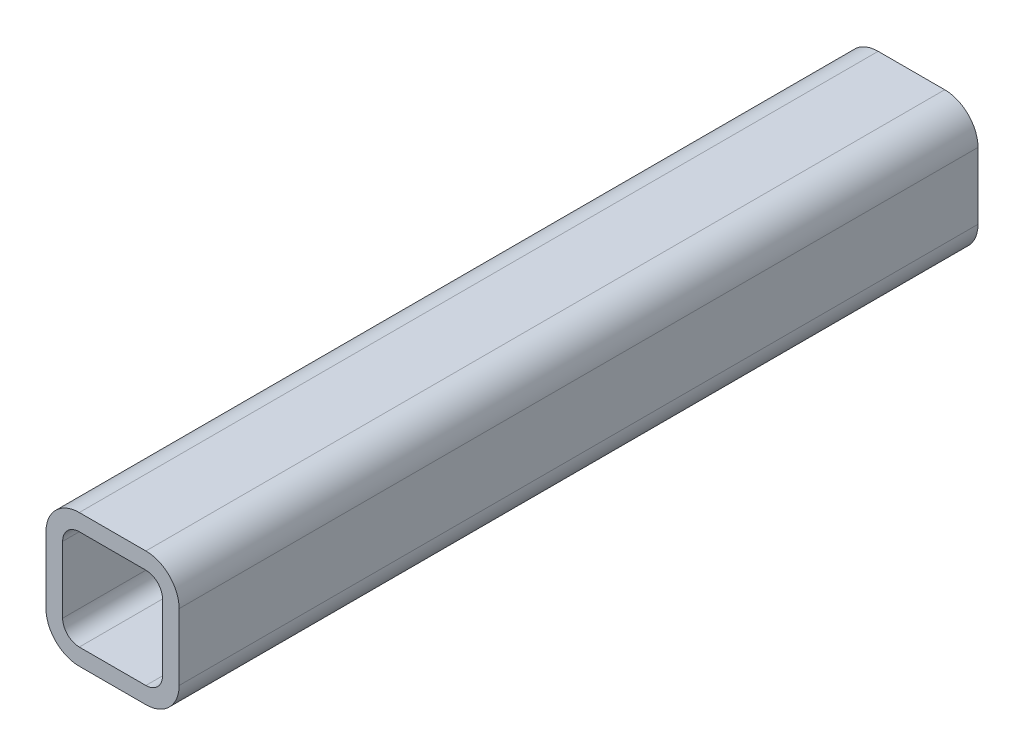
ISO-10303-21;
HEADER;
FILE_DESCRIPTION(('STEP AP214'),'2;1');
FILE_NAME('part.step','',(''),(''),'','','');
FILE_SCHEMA(('AUTOMOTIVE_DESIGN { 1 0 10303 214 1 1 1 1 }'));
ENDSEC;
DATA;
#1=APPLICATION_CONTEXT('core data for automotive mechanical design processes');
#2=APPLICATION_PROTOCOL_DEFINITION('international standard','automotive_design',2000,#1);
#3=PRODUCT_CONTEXT('',#1,'mechanical');
#4=PRODUCT('Part','Part','',(#3));
#5=PRODUCT_RELATED_PRODUCT_CATEGORY('part','',(#4));
#6=PRODUCT_DEFINITION_FORMATION('','',#4);
#7=PRODUCT_DEFINITION_CONTEXT('part definition',#1,'design');
#8=PRODUCT_DEFINITION('design','',#6,#7);
#9=PRODUCT_DEFINITION_SHAPE('','',#8);
#10=(LENGTH_UNIT() NAMED_UNIT(*) SI_UNIT(.MILLI.,.METRE.));
#11=(NAMED_UNIT(*) PLANE_ANGLE_UNIT() SI_UNIT($,.RADIAN.));
#12=(NAMED_UNIT(*) SI_UNIT($,.STERADIAN.) SOLID_ANGLE_UNIT());
#13=UNCERTAINTY_MEASURE_WITH_UNIT(LENGTH_MEASURE(1.E-05),#10,'distance_accuracy_value','');
#14=(GEOMETRIC_REPRESENTATION_CONTEXT(3) GLOBAL_UNCERTAINTY_ASSIGNED_CONTEXT((#13)) GLOBAL_UNIT_ASSIGNED_CONTEXT((#10,
#11,#12)) REPRESENTATION_CONTEXT('',''));
#15=CARTESIAN_POINT('',(0.,0.,0.));
#16=DIRECTION('',(0.,0.,1.));
#17=DIRECTION('',(1.,0.,0.));
#18=AXIS2_PLACEMENT_3D('',#15,#16,#17);
#19=CARTESIAN_POINT('',(11.422063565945,35.3750572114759,304.8));
#20=DIRECTION('',(0.,0.,1.));
#21=DIRECTION('',(1.,0.,0.));
#22=AXIS2_PLACEMENT_3D('',#19,#20,#21);
#23=PLANE('',#22);
#24=CARTESIAN_POINT('',(11.422063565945,35.3750572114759,304.8));
#25=DIRECTION('',(0.,0.,1.));
#26=DIRECTION('',(1.,0.,0.));
#27=AXIS2_PLACEMENT_3D('',#24,#25,#26);
#28=CIRCLE('',#27,12.7);
#29=CARTESIAN_POINT('',(11.422063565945,48.0750572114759,304.8));
#30=VERTEX_POINT('',#29);
#31=CARTESIAN_POINT('',(-1.27793643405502,35.3750572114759,304.8));
#32=VERTEX_POINT('',#31);
#33=EDGE_CURVE('E215',#30,#32,#28,.T.);
#34=ORIENTED_EDGE('',*,*,#33,.T.);
#35=DIRECTION('',(0.,-1.,0.));
#36=VECTOR('',#35,1.);
#37=CARTESIAN_POINT('',(-1.27793643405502,35.3750572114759,304.8));
#38=LINE('',#37,#36);
#39=CARTESIAN_POINT('',(-1.27793643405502,9.97505721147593,304.8));
#40=VERTEX_POINT('',#39);
#41=EDGE_CURVE('E218',#32,#40,#38,.T.);
#42=ORIENTED_EDGE('',*,*,#41,.T.);
#43=CARTESIAN_POINT('',(11.422063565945,9.97505721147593,304.8));
#44=DIRECTION('',(0.,0.,1.));
#45=DIRECTION('',(1.,0.,0.));
#46=AXIS2_PLACEMENT_3D('',#43,#44,#45);
#47=CIRCLE('',#46,12.7);
#48=CARTESIAN_POINT('',(11.422063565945,-2.72494278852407,304.8));
#49=VERTEX_POINT('',#48);
#50=EDGE_CURVE('E221',#40,#49,#47,.T.);
#51=ORIENTED_EDGE('',*,*,#50,.T.);
#52=DIRECTION('',(1.,0.,0.));
#53=VECTOR('',#52,1.);
#54=CARTESIAN_POINT('',(11.422063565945,-2.72494278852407,304.8));
#55=LINE('',#54,#53);
#56=CARTESIAN_POINT('',(36.822063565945,-2.72494278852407,304.8));
#57=VERTEX_POINT('',#56);
#58=EDGE_CURVE('E223',#49,#57,#55,.T.);
#59=ORIENTED_EDGE('',*,*,#58,.T.);
#60=CARTESIAN_POINT('',(36.822063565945,9.97505721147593,304.8));
#61=DIRECTION('',(0.,0.,1.));
#62=DIRECTION('',(1.,0.,0.));
#63=AXIS2_PLACEMENT_3D('',#60,#61,#62);
#64=CIRCLE('',#63,12.7);
#65=CARTESIAN_POINT('',(49.522063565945,9.97505721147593,304.8));
#66=VERTEX_POINT('',#65);
#67=EDGE_CURVE('E225',#57,#66,#64,.T.);
#68=ORIENTED_EDGE('',*,*,#67,.T.);
#69=DIRECTION('',(0.,1.,0.));
#70=VECTOR('',#69,1.);
#71=CARTESIAN_POINT('',(49.522063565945,9.97505721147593,304.8));
#72=LINE('',#71,#70);
#73=CARTESIAN_POINT('',(49.522063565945,35.3750572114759,304.8));
#74=VERTEX_POINT('',#73);
#75=EDGE_CURVE('E227',#66,#74,#72,.T.);
#76=ORIENTED_EDGE('',*,*,#75,.T.);
#77=CARTESIAN_POINT('',(36.822063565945,35.3750572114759,304.8));
#78=DIRECTION('',(0.,0.,1.));
#79=DIRECTION('',(1.,0.,0.));
#80=AXIS2_PLACEMENT_3D('',#77,#78,#79);
#81=CIRCLE('',#80,12.7);
#82=CARTESIAN_POINT('',(36.822063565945,48.0750572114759,304.8));
#83=VERTEX_POINT('',#82);
#84=EDGE_CURVE('E229',#74,#83,#81,.T.);
#85=ORIENTED_EDGE('',*,*,#84,.T.);
#86=DIRECTION('',(-1.,0.,0.));
#87=VECTOR('',#86,1.);
#88=CARTESIAN_POINT('',(36.822063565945,48.0750572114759,304.8));
#89=LINE('',#88,#87);
#90=EDGE_CURVE('E231',#83,#30,#89,.T.);
#91=ORIENTED_EDGE('',*,*,#90,.T.);
#92=EDGE_LOOP('',(#34,#42,#51,#59,#68,#76,#85,#91));
#93=FACE_BOUND('',#92,.T.);
#94=DIRECTION('',(0.,-1.,0.));
#95=VECTOR('',#94,1.);
#96=CARTESIAN_POINT('',(5.07206356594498,9.97505721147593,304.8));
#97=LINE('',#96,#95);
#98=CARTESIAN_POINT('',(5.07206356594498,35.3750572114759,304.8));
#99=VERTEX_POINT('',#98);
#100=CARTESIAN_POINT('',(5.07206356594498,9.97505721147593,304.8));
#101=VERTEX_POINT('',#100);
#102=EDGE_CURVE('E158',#99,#101,#97,.T.);
#103=ORIENTED_EDGE('',*,*,#102,.F.);
#104=CARTESIAN_POINT('',(11.422063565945,35.3750572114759,304.8));
#105=DIRECTION('',(0.,0.,1.));
#106=DIRECTION('',(1.,0.,0.));
#107=AXIS2_PLACEMENT_3D('',#104,#105,#106);
#108=CIRCLE('',#107,6.35);
#109=CARTESIAN_POINT('',(11.422063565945,41.7250572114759,304.8));
#110=VERTEX_POINT('',#109);
#111=EDGE_CURVE('E150',#110,#99,#108,.T.);
#112=ORIENTED_EDGE('',*,*,#111,.F.);
#113=DIRECTION('',(-1.,0.,0.));
#114=VECTOR('',#113,1.);
#115=CARTESIAN_POINT('',(11.422063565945,41.7250572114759,304.8));
#116=LINE('',#115,#114);
#117=CARTESIAN_POINT('',(36.822063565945,41.7250572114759,304.8));
#118=VERTEX_POINT('',#117);
#119=EDGE_CURVE('E183',#118,#110,#116,.T.);
#120=ORIENTED_EDGE('',*,*,#119,.F.);
#121=CARTESIAN_POINT('',(36.822063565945,35.3750572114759,304.8));
#122=DIRECTION('',(0.,0.,1.));
#123=DIRECTION('',(1.,0.,0.));
#124=AXIS2_PLACEMENT_3D('',#121,#122,#123);
#125=CIRCLE('',#124,6.34999999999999);
#126=CARTESIAN_POINT('',(43.172063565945,35.3750572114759,304.8));
#127=VERTEX_POINT('',#126);
#128=EDGE_CURVE('E181',#127,#118,#125,.T.);
#129=ORIENTED_EDGE('',*,*,#128,.F.);
#130=DIRECTION('',(0.,1.,0.));
#131=VECTOR('',#130,1.);
#132=CARTESIAN_POINT('',(43.172063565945,35.3750572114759,304.8));
#133=LINE('',#132,#131);
#134=CARTESIAN_POINT('',(43.172063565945,9.97505721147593,304.8));
#135=VERTEX_POINT('',#134);
#136=EDGE_CURVE('E179',#135,#127,#133,.T.);
#137=ORIENTED_EDGE('',*,*,#136,.F.);
#138=CARTESIAN_POINT('',(36.822063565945,9.97505721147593,304.8));
#139=DIRECTION('',(0.,0.,1.));
#140=DIRECTION('',(1.,0.,0.));
#141=AXIS2_PLACEMENT_3D('',#138,#139,#140);
#142=CIRCLE('',#141,6.35);
#143=CARTESIAN_POINT('',(36.822063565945,3.62505721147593,304.8));
#144=VERTEX_POINT('',#143);
#145=EDGE_CURVE('E177',#144,#135,#142,.T.);
#146=ORIENTED_EDGE('',*,*,#145,.F.);
#147=DIRECTION('',(1.,0.,0.));
#148=VECTOR('',#147,1.);
#149=CARTESIAN_POINT('',(36.822063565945,3.62505721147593,304.8));
#150=LINE('',#149,#148);
#151=CARTESIAN_POINT('',(11.422063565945,3.62505721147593,304.8));
#152=VERTEX_POINT('',#151);
#153=EDGE_CURVE('E173',#152,#144,#150,.T.);
#154=ORIENTED_EDGE('',*,*,#153,.F.);
#155=CARTESIAN_POINT('',(11.422063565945,9.97505721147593,304.8));
#156=DIRECTION('',(0.,0.,1.));
#157=DIRECTION('',(1.,0.,0.));
#158=AXIS2_PLACEMENT_3D('',#155,#156,#157);
#159=CIRCLE('',#158,6.35);
#160=EDGE_CURVE('E171',#101,#152,#159,.T.);
#161=ORIENTED_EDGE('',*,*,#160,.F.);
#162=EDGE_LOOP('',(#103,#112,#120,#129,#137,#146,#154,#161));
#163=FACE_BOUND('',#162,.T.);
#164=ADVANCED_FACE('F37',(#93,#163),#23,.T.);
#165=CARTESIAN_POINT('',(11.422063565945,35.3750572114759,0.));
#166=DIRECTION('',(0.,0.,1.));
#167=DIRECTION('',(1.,0.,0.));
#168=AXIS2_PLACEMENT_3D('',#165,#166,#167);
#169=PLANE('',#168);
#170=CARTESIAN_POINT('',(11.422063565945,35.3750572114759,0.));
#171=DIRECTION('',(0.,0.,1.));
#172=DIRECTION('',(1.,0.,0.));
#173=AXIS2_PLACEMENT_3D('',#170,#171,#172);
#174=CIRCLE('',#173,12.7);
#175=CARTESIAN_POINT('',(11.422063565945,48.0750572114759,0.));
#176=VERTEX_POINT('',#175);
#177=CARTESIAN_POINT('',(-1.27793643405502,35.3750572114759,0.));
#178=VERTEX_POINT('',#177);
#179=EDGE_CURVE('E166',#176,#178,#174,.T.);
#180=ORIENTED_EDGE('',*,*,#179,.F.);
#181=DIRECTION('',(-1.,0.,0.));
#182=VECTOR('',#181,1.);
#183=CARTESIAN_POINT('',(36.822063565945,48.0750572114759,0.));
#184=LINE('',#183,#182);
#185=CARTESIAN_POINT('',(36.822063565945,48.0750572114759,0.));
#186=VERTEX_POINT('',#185);
#187=EDGE_CURVE('E219',#186,#176,#184,.T.);
#188=ORIENTED_EDGE('',*,*,#187,.F.);
#189=CARTESIAN_POINT('',(36.822063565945,35.3750572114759,0.));
#190=DIRECTION('',(0.,0.,1.));
#191=DIRECTION('',(1.,0.,0.));
#192=AXIS2_PLACEMENT_3D('',#189,#190,#191);
#193=CIRCLE('',#192,12.7);
#194=CARTESIAN_POINT('',(49.522063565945,35.3750572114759,0.));
#195=VERTEX_POINT('',#194);
#196=EDGE_CURVE('E246',#195,#186,#193,.T.);
#197=ORIENTED_EDGE('',*,*,#196,.F.);
#198=DIRECTION('',(0.,1.,0.));
#199=VECTOR('',#198,1.);
#200=CARTESIAN_POINT('',(49.522063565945,9.97505721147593,0.));
#201=LINE('',#200,#199);
#202=CARTESIAN_POINT('',(49.522063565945,9.97505721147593,0.));
#203=VERTEX_POINT('',#202);
#204=EDGE_CURVE('E244',#203,#195,#201,.T.);
#205=ORIENTED_EDGE('',*,*,#204,.F.);
#206=CARTESIAN_POINT('',(36.822063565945,9.97505721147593,0.));
#207=DIRECTION('',(0.,0.,1.));
#208=DIRECTION('',(1.,0.,0.));
#209=AXIS2_PLACEMENT_3D('',#206,#207,#208);
#210=CIRCLE('',#209,12.7);
#211=CARTESIAN_POINT('',(36.822063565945,-2.72494278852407,0.));
#212=VERTEX_POINT('',#211);
#213=EDGE_CURVE('E242',#212,#203,#210,.T.);
#214=ORIENTED_EDGE('',*,*,#213,.F.);
#215=DIRECTION('',(1.,0.,0.));
#216=VECTOR('',#215,1.);
#217=CARTESIAN_POINT('',(11.422063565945,-2.72494278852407,0.));
#218=LINE('',#217,#216);
#219=CARTESIAN_POINT('',(11.422063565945,-2.72494278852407,0.));
#220=VERTEX_POINT('',#219);
#221=EDGE_CURVE('E240',#220,#212,#218,.T.);
#222=ORIENTED_EDGE('',*,*,#221,.F.);
#223=CARTESIAN_POINT('',(11.422063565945,9.97505721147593,0.));
#224=DIRECTION('',(0.,0.,1.));
#225=DIRECTION('',(1.,0.,0.));
#226=AXIS2_PLACEMENT_3D('',#223,#224,#225);
#227=CIRCLE('',#226,12.7);
#228=CARTESIAN_POINT('',(-1.27793643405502,9.97505721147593,0.));
#229=VERTEX_POINT('',#228);
#230=EDGE_CURVE('E238',#229,#220,#227,.T.);
#231=ORIENTED_EDGE('',*,*,#230,.F.);
#232=DIRECTION('',(0.,-1.,0.));
#233=VECTOR('',#232,1.);
#234=CARTESIAN_POINT('',(-1.27793643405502,35.3750572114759,0.));
#235=LINE('',#234,#233);
#236=EDGE_CURVE('E236',#178,#229,#235,.T.);
#237=ORIENTED_EDGE('',*,*,#236,.F.);
#238=EDGE_LOOP('',(#180,#188,#197,#205,#214,#222,#231,#237));
#239=FACE_BOUND('',#238,.T.);
#240=CARTESIAN_POINT('',(11.422063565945,35.3750572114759,0.));
#241=DIRECTION('',(0.,0.,1.));
#242=DIRECTION('',(1.,0.,0.));
#243=AXIS2_PLACEMENT_3D('',#240,#241,#242);
#244=CIRCLE('',#243,6.35);
#245=CARTESIAN_POINT('',(11.422063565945,41.7250572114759,0.));
#246=VERTEX_POINT('',#245);
#247=CARTESIAN_POINT('',(5.07206356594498,35.3750572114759,0.));
#248=VERTEX_POINT('',#247);
#249=EDGE_CURVE('E60',#246,#248,#244,.T.);
#250=ORIENTED_EDGE('',*,*,#249,.T.);
#251=DIRECTION('',(0.,-1.,0.));
#252=VECTOR('',#251,1.);
#253=CARTESIAN_POINT('',(5.07206356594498,9.97505721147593,0.));
#254=LINE('',#253,#252);
#255=CARTESIAN_POINT('',(5.07206356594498,9.97505721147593,0.));
#256=VERTEX_POINT('',#255);
#257=EDGE_CURVE('E165',#248,#256,#254,.T.);
#258=ORIENTED_EDGE('',*,*,#257,.T.);
#259=CARTESIAN_POINT('',(11.422063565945,9.97505721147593,0.));
#260=DIRECTION('',(0.,0.,1.));
#261=DIRECTION('',(1.,0.,0.));
#262=AXIS2_PLACEMENT_3D('',#259,#260,#261);
#263=CIRCLE('',#262,6.35);
#264=CARTESIAN_POINT('',(11.422063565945,3.62505721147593,0.));
#265=VERTEX_POINT('',#264);
#266=EDGE_CURVE('E187',#256,#265,#263,.T.);
#267=ORIENTED_EDGE('',*,*,#266,.T.);
#268=DIRECTION('',(1.,0.,0.));
#269=VECTOR('',#268,1.);
#270=CARTESIAN_POINT('',(36.822063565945,3.62505721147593,0.));
#271=LINE('',#270,#269);
#272=CARTESIAN_POINT('',(36.822063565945,3.62505721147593,0.));
#273=VERTEX_POINT('',#272);
#274=EDGE_CURVE('E190',#265,#273,#271,.T.);
#275=ORIENTED_EDGE('',*,*,#274,.T.);
#276=CARTESIAN_POINT('',(36.822063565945,9.97505721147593,0.));
#277=DIRECTION('',(0.,0.,1.));
#278=DIRECTION('',(1.,0.,0.));
#279=AXIS2_PLACEMENT_3D('',#276,#277,#278);
#280=CIRCLE('',#279,6.35);
#281=CARTESIAN_POINT('',(43.172063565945,9.97505721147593,0.));
#282=VERTEX_POINT('',#281);
#283=EDGE_CURVE('E193',#273,#282,#280,.T.);
#284=ORIENTED_EDGE('',*,*,#283,.T.);
#285=DIRECTION('',(0.,1.,0.));
#286=VECTOR('',#285,1.);
#287=CARTESIAN_POINT('',(43.172063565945,35.3750572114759,0.));
#288=LINE('',#287,#286);
#289=CARTESIAN_POINT('',(43.172063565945,35.3750572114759,0.));
#290=VERTEX_POINT('',#289);
#291=EDGE_CURVE('E196',#282,#290,#288,.T.);
#292=ORIENTED_EDGE('',*,*,#291,.T.);
#293=CARTESIAN_POINT('',(36.822063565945,35.3750572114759,0.));
#294=DIRECTION('',(0.,0.,1.));
#295=DIRECTION('',(1.,0.,0.));
#296=AXIS2_PLACEMENT_3D('',#293,#294,#295);
#297=CIRCLE('',#296,6.34999999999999);
#298=CARTESIAN_POINT('',(36.822063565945,41.7250572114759,0.));
#299=VERTEX_POINT('',#298);
#300=EDGE_CURVE('E199',#290,#299,#297,.T.);
#301=ORIENTED_EDGE('',*,*,#300,.T.);
#302=DIRECTION('',(-1.,0.,0.));
#303=VECTOR('',#302,1.);
#304=CARTESIAN_POINT('',(11.422063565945,41.7250572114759,0.));
#305=LINE('',#304,#303);
#306=EDGE_CURVE('E159',#299,#246,#305,.T.);
#307=ORIENTED_EDGE('',*,*,#306,.T.);
#308=EDGE_LOOP('',(#250,#258,#267,#275,#284,#292,#301,#307));
#309=FACE_BOUND('',#308,.T.);
#310=ADVANCED_FACE('F276',(#239,#309),#169,.F.);
#311=CARTESIAN_POINT('',(11.422063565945,35.3750572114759,304.8));
#312=DIRECTION('',(0.,0.,-1.));
#313=DIRECTION('',(-1.,0.,0.));
#314=AXIS2_PLACEMENT_3D('',#311,#312,#313);
#315=CYLINDRICAL_SURFACE('',#314,12.7);
#316=ORIENTED_EDGE('',*,*,#179,.T.);
#317=DIRECTION('',(0.,0.,-1.));
#318=VECTOR('',#317,1.);
#319=CARTESIAN_POINT('',(-1.27793643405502,35.3750572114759,304.8));
#320=LINE('',#319,#318);
#321=EDGE_CURVE('E11',#32,#178,#320,.T.);
#322=ORIENTED_EDGE('',*,*,#321,.F.);
#323=ORIENTED_EDGE('',*,*,#33,.F.);
#324=DIRECTION('',(0.,0.,-1.));
#325=VECTOR('',#324,1.);
#326=CARTESIAN_POINT('',(11.422063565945,48.0750572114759,304.8));
#327=LINE('',#326,#325);
#328=EDGE_CURVE('E233',#30,#176,#327,.T.);
#329=ORIENTED_EDGE('',*,*,#328,.T.);
#330=EDGE_LOOP('',(#316,#322,#323,#329));
#331=FACE_BOUND('',#330,.T.);
#332=ADVANCED_FACE('F39',(#331),#315,.T.);
#333=CARTESIAN_POINT('',(-1.27793643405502,35.3750572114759,304.8));
#334=DIRECTION('',(1.,0.,0.));
#335=DIRECTION('',(0.,0.,-1.));
#336=AXIS2_PLACEMENT_3D('',#333,#334,#335);
#337=PLANE('',#336);
#338=ORIENTED_EDGE('',*,*,#236,.T.);
#339=DIRECTION('',(0.,0.,-1.));
#340=VECTOR('',#339,1.);
#341=CARTESIAN_POINT('',(-1.27793643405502,9.97505721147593,304.8));
#342=LINE('',#341,#340);
#343=EDGE_CURVE('E45',#40,#229,#342,.T.);
#344=ORIENTED_EDGE('',*,*,#343,.F.);
#345=ORIENTED_EDGE('',*,*,#41,.F.);
#346=ORIENTED_EDGE('',*,*,#321,.T.);
#347=EDGE_LOOP('',(#338,#344,#345,#346));
#348=FACE_BOUND('',#347,.T.);
#349=ADVANCED_FACE('F293',(#348),#337,.F.);
#350=CARTESIAN_POINT('',(11.422063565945,9.97505721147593,304.8));
#351=DIRECTION('',(0.,0.,-1.));
#352=DIRECTION('',(-1.,0.,0.));
#353=AXIS2_PLACEMENT_3D('',#350,#351,#352);
#354=CYLINDRICAL_SURFACE('',#353,12.7);
#355=ORIENTED_EDGE('',*,*,#230,.T.);
#356=DIRECTION('',(0.,0.,-1.));
#357=VECTOR('',#356,1.);
#358=CARTESIAN_POINT('',(11.422063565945,-2.72494278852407,304.8));
#359=LINE('',#358,#357);
#360=EDGE_CURVE('E263',#49,#220,#359,.T.);
#361=ORIENTED_EDGE('',*,*,#360,.F.);
#362=ORIENTED_EDGE('',*,*,#50,.F.);
#363=ORIENTED_EDGE('',*,*,#343,.T.);
#364=EDGE_LOOP('',(#355,#361,#362,#363));
#365=FACE_BOUND('',#364,.T.);
#366=ADVANCED_FACE('F270',(#365),#354,.T.);
#367=CARTESIAN_POINT('',(11.422063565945,-2.72494278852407,304.8));
#368=DIRECTION('',(0.,1.,0.));
#369=DIRECTION('',(0.,0.,1.));
#370=AXIS2_PLACEMENT_3D('',#367,#368,#369);
#371=PLANE('',#370);
#372=ORIENTED_EDGE('',*,*,#221,.T.);
#373=DIRECTION('',(0.,0.,-1.));
#374=VECTOR('',#373,1.);
#375=CARTESIAN_POINT('',(36.822063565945,-2.72494278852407,304.8));
#376=LINE('',#375,#374);
#377=EDGE_CURVE('E260',#57,#212,#376,.T.);
#378=ORIENTED_EDGE('',*,*,#377,.F.);
#379=ORIENTED_EDGE('',*,*,#58,.F.);
#380=ORIENTED_EDGE('',*,*,#360,.T.);
#381=EDGE_LOOP('',(#372,#378,#379,#380));
#382=FACE_BOUND('',#381,.T.);
#383=ADVANCED_FACE('F282',(#382),#371,.F.);
#384=CARTESIAN_POINT('',(36.822063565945,9.97505721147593,304.8));
#385=DIRECTION('',(0.,0.,-1.));
#386=DIRECTION('',(-1.,0.,0.));
#387=AXIS2_PLACEMENT_3D('',#384,#385,#386);
#388=CYLINDRICAL_SURFACE('',#387,12.7);
#389=ORIENTED_EDGE('',*,*,#213,.T.);
#390=DIRECTION('',(0.,0.,-1.));
#391=VECTOR('',#390,1.);
#392=CARTESIAN_POINT('',(49.522063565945,9.97505721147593,304.8));
#393=LINE('',#392,#391);
#394=EDGE_CURVE('E257',#66,#203,#393,.T.);
#395=ORIENTED_EDGE('',*,*,#394,.F.);
#396=ORIENTED_EDGE('',*,*,#67,.F.);
#397=ORIENTED_EDGE('',*,*,#377,.T.);
#398=EDGE_LOOP('',(#389,#395,#396,#397));
#399=FACE_BOUND('',#398,.T.);
#400=ADVANCED_FACE('F286',(#399),#388,.T.);
#401=CARTESIAN_POINT('',(49.522063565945,9.97505721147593,304.8));
#402=DIRECTION('',(-1.,0.,0.));
#403=DIRECTION('',(0.,0.,1.));
#404=AXIS2_PLACEMENT_3D('',#401,#402,#403);
#405=PLANE('',#404);
#406=ORIENTED_EDGE('',*,*,#204,.T.);
#407=DIRECTION('',(0.,0.,-1.));
#408=VECTOR('',#407,1.);
#409=CARTESIAN_POINT('',(49.522063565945,35.3750572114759,304.8));
#410=LINE('',#409,#408);
#411=EDGE_CURVE('E254',#74,#195,#410,.T.);
#412=ORIENTED_EDGE('',*,*,#411,.F.);
#413=ORIENTED_EDGE('',*,*,#75,.F.);
#414=ORIENTED_EDGE('',*,*,#394,.T.);
#415=EDGE_LOOP('',(#406,#412,#413,#414));
#416=FACE_BOUND('',#415,.T.);
#417=ADVANCED_FACE('F306',(#416),#405,.F.);
#418=CARTESIAN_POINT('',(36.822063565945,35.3750572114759,304.8));
#419=DIRECTION('',(0.,0.,-1.));
#420=DIRECTION('',(-1.,0.,0.));
#421=AXIS2_PLACEMENT_3D('',#418,#419,#420);
#422=CYLINDRICAL_SURFACE('',#421,12.7);
#423=ORIENTED_EDGE('',*,*,#196,.T.);
#424=DIRECTION('',(0.,0.,-1.));
#425=VECTOR('',#424,1.);
#426=CARTESIAN_POINT('',(36.822063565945,48.0750572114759,304.8));
#427=LINE('',#426,#425);
#428=EDGE_CURVE('E251',#83,#186,#427,.T.);
#429=ORIENTED_EDGE('',*,*,#428,.F.);
#430=ORIENTED_EDGE('',*,*,#84,.F.);
#431=ORIENTED_EDGE('',*,*,#411,.T.);
#432=EDGE_LOOP('',(#423,#429,#430,#431));
#433=FACE_BOUND('',#432,.T.);
#434=ADVANCED_FACE('F304',(#433),#422,.T.);
#435=CARTESIAN_POINT('',(36.822063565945,48.0750572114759,304.8));
#436=DIRECTION('',(0.,-1.,0.));
#437=DIRECTION('',(0.,0.,-1.));
#438=AXIS2_PLACEMENT_3D('',#435,#436,#437);
#439=PLANE('',#438);
#440=ORIENTED_EDGE('',*,*,#187,.T.);
#441=ORIENTED_EDGE('',*,*,#328,.F.);
#442=ORIENTED_EDGE('',*,*,#90,.F.);
#443=ORIENTED_EDGE('',*,*,#428,.T.);
#444=EDGE_LOOP('',(#440,#441,#442,#443));
#445=FACE_BOUND('',#444,.T.);
#446=ADVANCED_FACE('F299',(#445),#439,.F.);
#447=CARTESIAN_POINT('',(11.422063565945,35.3750572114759,304.8));
#448=DIRECTION('',(0.,0.,-1.));
#449=DIRECTION('',(-1.,0.,0.));
#450=AXIS2_PLACEMENT_3D('',#447,#448,#449);
#451=CYLINDRICAL_SURFACE('',#450,6.35);
#452=ORIENTED_EDGE('',*,*,#249,.F.);
#453=DIRECTION('',(0.,0.,-1.));
#454=VECTOR('',#453,1.);
#455=CARTESIAN_POINT('',(11.422063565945,41.7250572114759,304.8));
#456=LINE('',#455,#454);
#457=EDGE_CURVE('E154',#110,#246,#456,.T.);
#458=ORIENTED_EDGE('',*,*,#457,.F.);
#459=ORIENTED_EDGE('',*,*,#111,.T.);
#460=DIRECTION('',(0.,0.,-1.));
#461=VECTOR('',#460,1.);
#462=CARTESIAN_POINT('',(5.07206356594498,35.3750572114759,304.8));
#463=LINE('',#462,#461);
#464=EDGE_CURVE('E153',#99,#248,#463,.T.);
#465=ORIENTED_EDGE('',*,*,#464,.T.);
#466=EDGE_LOOP('',(#452,#458,#459,#465));
#467=FACE_BOUND('',#466,.T.);
#468=ADVANCED_FACE('F152',(#467),#451,.F.);
#469=CARTESIAN_POINT('',(5.07206356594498,9.97505721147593,304.8));
#470=DIRECTION('',(1.,0.,0.));
#471=DIRECTION('',(0.,0.,-1.));
#472=AXIS2_PLACEMENT_3D('',#469,#470,#471);
#473=PLANE('',#472);
#474=ORIENTED_EDGE('',*,*,#257,.F.);
#475=ORIENTED_EDGE('',*,*,#464,.F.);
#476=ORIENTED_EDGE('',*,*,#102,.T.);
#477=DIRECTION('',(0.,0.,-1.));
#478=VECTOR('',#477,1.);
#479=CARTESIAN_POINT('',(5.07206356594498,9.97505721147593,304.8));
#480=LINE('',#479,#478);
#481=EDGE_CURVE('E167',#101,#256,#480,.T.);
#482=ORIENTED_EDGE('',*,*,#481,.T.);
#483=EDGE_LOOP('',(#474,#475,#476,#482));
#484=FACE_BOUND('',#483,.T.);
#485=ADVANCED_FACE('F162',(#484),#473,.T.);
#486=CARTESIAN_POINT('',(11.422063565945,9.97505721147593,304.8));
#487=DIRECTION('',(0.,0.,-1.));
#488=DIRECTION('',(-1.,0.,0.));
#489=AXIS2_PLACEMENT_3D('',#486,#487,#488);
#490=CYLINDRICAL_SURFACE('',#489,6.35);
#491=ORIENTED_EDGE('',*,*,#266,.F.);
#492=ORIENTED_EDGE('',*,*,#481,.F.);
#493=ORIENTED_EDGE('',*,*,#160,.T.);
#494=DIRECTION('',(0.,0.,-1.));
#495=VECTOR('',#494,1.);
#496=CARTESIAN_POINT('',(11.422063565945,3.62505721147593,304.8));
#497=LINE('',#496,#495);
#498=EDGE_CURVE('E212',#152,#265,#497,.T.);
#499=ORIENTED_EDGE('',*,*,#498,.T.);
#500=EDGE_LOOP('',(#491,#492,#493,#499));
#501=FACE_BOUND('',#500,.T.);
#502=ADVANCED_FACE('F331',(#501),#490,.F.);
#503=CARTESIAN_POINT('',(36.822063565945,3.62505721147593,304.8));
#504=DIRECTION('',(0.,1.,0.));
#505=DIRECTION('',(0.,0.,1.));
#506=AXIS2_PLACEMENT_3D('',#503,#504,#505);
#507=PLANE('',#506);
#508=ORIENTED_EDGE('',*,*,#274,.F.);
#509=ORIENTED_EDGE('',*,*,#498,.F.);
#510=ORIENTED_EDGE('',*,*,#153,.T.);
#511=DIRECTION('',(0.,0.,-1.));
#512=VECTOR('',#511,1.);
#513=CARTESIAN_POINT('',(36.822063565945,3.62505721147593,304.8));
#514=LINE('',#513,#512);
#515=EDGE_CURVE('E210',#144,#273,#514,.T.);
#516=ORIENTED_EDGE('',*,*,#515,.T.);
#517=EDGE_LOOP('',(#508,#509,#510,#516));
#518=FACE_BOUND('',#517,.T.);
#519=ADVANCED_FACE('F335',(#518),#507,.T.);
#520=CARTESIAN_POINT('',(36.822063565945,9.97505721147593,304.8));
#521=DIRECTION('',(0.,0.,-1.));
#522=DIRECTION('',(-1.,0.,0.));
#523=AXIS2_PLACEMENT_3D('',#520,#521,#522);
#524=CYLINDRICAL_SURFACE('',#523,6.35);
#525=ORIENTED_EDGE('',*,*,#283,.F.);
#526=ORIENTED_EDGE('',*,*,#515,.F.);
#527=ORIENTED_EDGE('',*,*,#145,.T.);
#528=DIRECTION('',(0.,0.,-1.));
#529=VECTOR('',#528,1.);
#530=CARTESIAN_POINT('',(43.172063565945,9.97505721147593,304.8));
#531=LINE('',#530,#529);
#532=EDGE_CURVE('E208',#135,#282,#531,.T.);
#533=ORIENTED_EDGE('',*,*,#532,.T.);
#534=EDGE_LOOP('',(#525,#526,#527,#533));
#535=FACE_BOUND('',#534,.T.);
#536=ADVANCED_FACE('F341',(#535),#524,.F.);
#537=CARTESIAN_POINT('',(43.172063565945,35.3750572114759,304.8));
#538=DIRECTION('',(-1.,0.,0.));
#539=DIRECTION('',(0.,0.,1.));
#540=AXIS2_PLACEMENT_3D('',#537,#538,#539);
#541=PLANE('',#540);
#542=ORIENTED_EDGE('',*,*,#291,.F.);
#543=ORIENTED_EDGE('',*,*,#532,.F.);
#544=ORIENTED_EDGE('',*,*,#136,.T.);
#545=DIRECTION('',(0.,0.,-1.));
#546=VECTOR('',#545,1.);
#547=CARTESIAN_POINT('',(43.172063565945,35.3750572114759,304.8));
#548=LINE('',#547,#546);
#549=EDGE_CURVE('E206',#127,#290,#548,.T.);
#550=ORIENTED_EDGE('',*,*,#549,.T.);
#551=EDGE_LOOP('',(#542,#543,#544,#550));
#552=FACE_BOUND('',#551,.T.);
#553=ADVANCED_FACE('F345',(#552),#541,.T.);
#554=CARTESIAN_POINT('',(36.822063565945,35.3750572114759,304.8));
#555=DIRECTION('',(0.,0.,-1.));
#556=DIRECTION('',(-1.,0.,0.));
#557=AXIS2_PLACEMENT_3D('',#554,#555,#556);
#558=CYLINDRICAL_SURFACE('',#557,6.34999999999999);
#559=ORIENTED_EDGE('',*,*,#300,.F.);
#560=ORIENTED_EDGE('',*,*,#549,.F.);
#561=ORIENTED_EDGE('',*,*,#128,.T.);
#562=DIRECTION('',(0.,0.,-1.));
#563=VECTOR('',#562,1.);
#564=CARTESIAN_POINT('',(36.822063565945,41.7250572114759,304.8));
#565=LINE('',#564,#563);
#566=EDGE_CURVE('E52',#118,#299,#565,.T.);
#567=ORIENTED_EDGE('',*,*,#566,.T.);
#568=EDGE_LOOP('',(#559,#560,#561,#567));
#569=FACE_BOUND('',#568,.T.);
#570=ADVANCED_FACE('F349',(#569),#558,.F.);
#571=CARTESIAN_POINT('',(11.422063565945,41.7250572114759,304.8));
#572=DIRECTION('',(0.,-1.,0.));
#573=DIRECTION('',(0.,0.,-1.));
#574=AXIS2_PLACEMENT_3D('',#571,#572,#573);
#575=PLANE('',#574);
#576=ORIENTED_EDGE('',*,*,#306,.F.);
#577=ORIENTED_EDGE('',*,*,#566,.F.);
#578=ORIENTED_EDGE('',*,*,#119,.T.);
#579=ORIENTED_EDGE('',*,*,#457,.T.);
#580=EDGE_LOOP('',(#576,#577,#578,#579));
#581=FACE_BOUND('',#580,.T.);
#582=ADVANCED_FACE('F353',(#581),#575,.T.);
#583=CLOSED_SHELL('',(#164,#310,#332,#349,#366,#383,#400,#417,#434,#446,#468,#485,#502,#519,
#536,#553,#570,#582));
#584=MANIFOLD_SOLID_BREP('B2',#583);
#585=ADVANCED_BREP_SHAPE_REPRESENTATION('',(#18,#584),#14);
#586=SHAPE_DEFINITION_REPRESENTATION(#9,#585);
ENDSEC;
END-ISO-10303-21;
